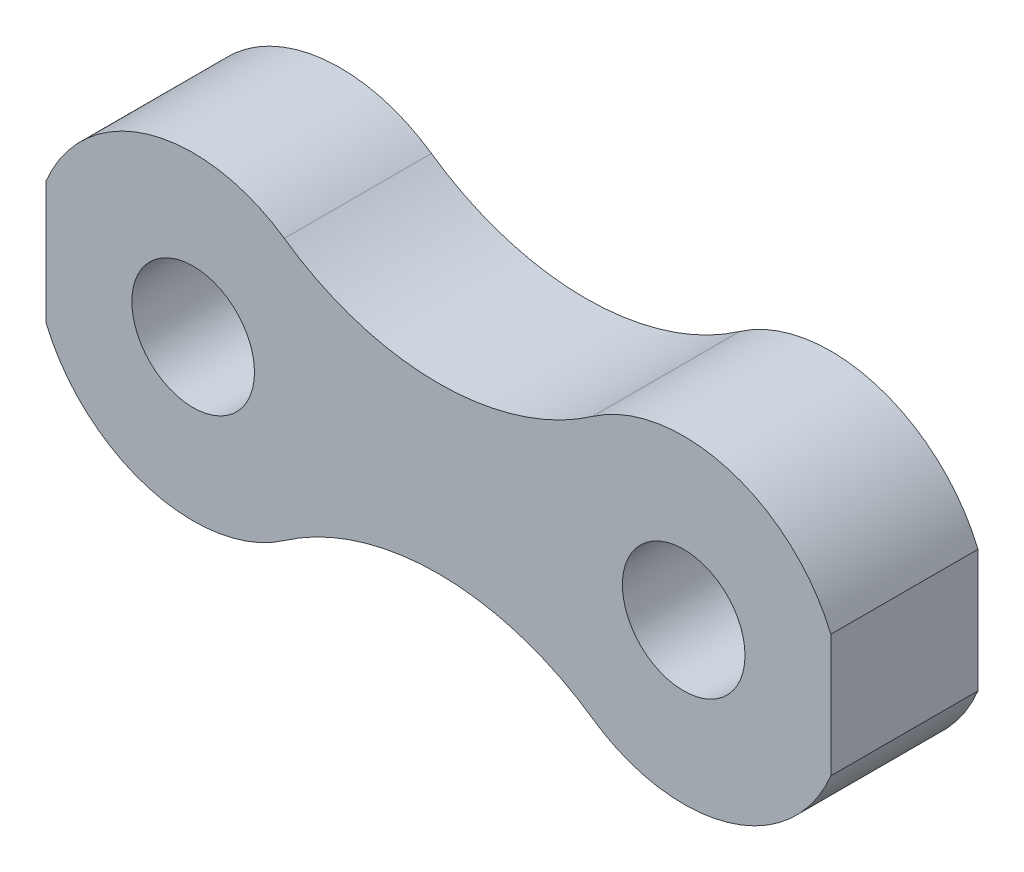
from build123d import *

# Parameters (mm, degrees)
SKIZZE1_R                       = 2.5
LINEAR_AUSTRAGEN2_DEPTH         = 3
SKIZZE2_OUTSIDE_W               = 42.194
SKIZZE2_OUTSIDE_H               = 22.194
SKIZZE2_OUTSIDE_W_2             = 32
SKIZZE2_OUTSIDE_H_2             = 20.024739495
SCHNITT_LINEAR_AUSTRAGEN1_DEPTH = 28.937430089


with BuildPart() as part:
    # Skizze1 → Linear austragen2 (new, symmetric)
    with BuildSketch(Plane.XY):
        with BuildLine():
            ThreePointArc((3.714285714, 5.334236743), (-6.5, 0), (3.714285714, -5.334236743))
            ThreePointArc((3.714285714, -5.334236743), (10, -3.361406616), (16.285714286, -5.334236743))
            ThreePointArc((16.285714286, -5.334236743), (26.5, 0), (16.285714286, 5.334236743))
            ThreePointArc((16.285714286, 5.334236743), (10, 3.361406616), (3.714285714, 5.334236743))
        make_face()
        Circle(SKIZZE1_R, mode=Mode.SUBTRACT)
        with Locations((20, 0)):
            Circle(SKIZZE1_R, mode=Mode.SUBTRACT)
    extrude(amount=LINEAR_AUSTRAGEN2_DEPTH, both=True)

    # Skizze2 outside → Schnitt-Linear austragen1 (cut, through all)
    with BuildSketch(Plane.XY.offset(3)):
        with Locations((10, 0)):
            Rectangle(SKIZZE2_OUTSIDE_W, SKIZZE2_OUTSIDE_H)
        with Locations((10, 0.50545115)):
            Rectangle(SKIZZE2_OUTSIDE_W_2, SKIZZE2_OUTSIDE_H_2, mode=Mode.SUBTRACT)
    extrude(amount=-SCHNITT_LINEAR_AUSTRAGEN1_DEPTH, mode=Mode.SUBTRACT)


solid = part.part
